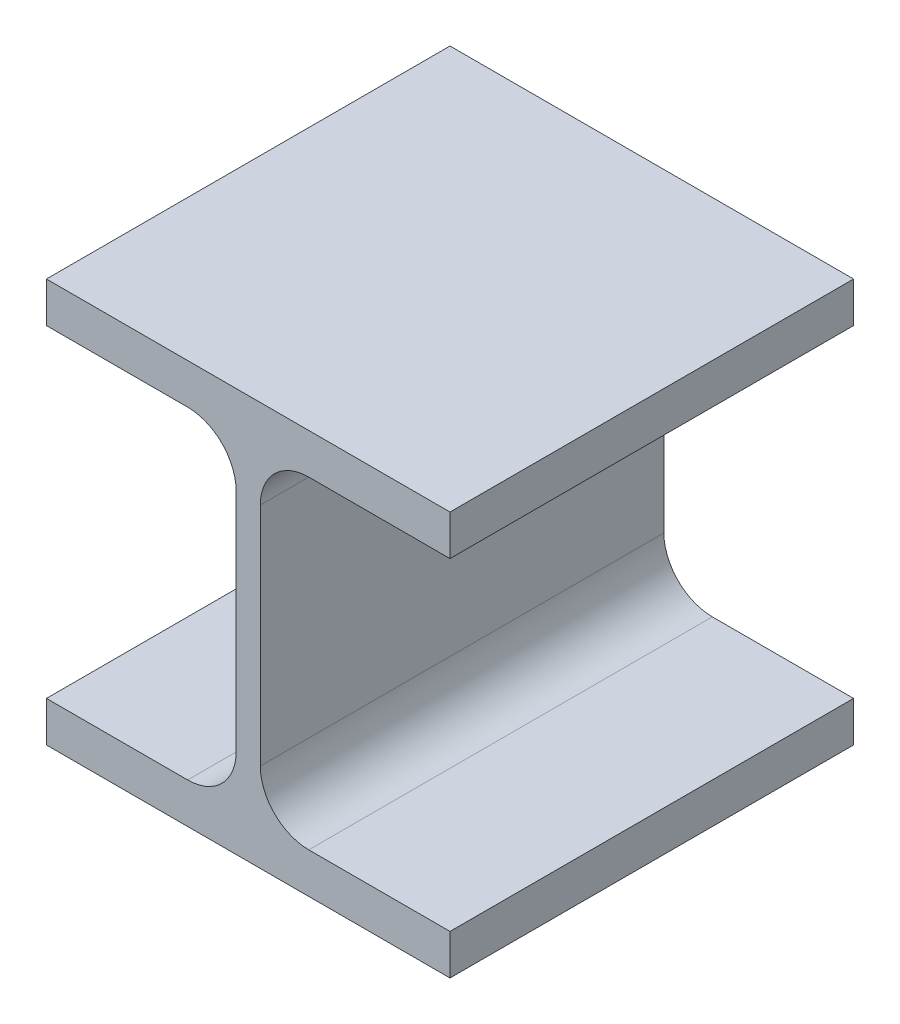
ISO-10303-21;
HEADER;
FILE_DESCRIPTION(('STEP AP214'),'2;1');
FILE_NAME('part.step','',(''),(''),'','','');
FILE_SCHEMA(('AUTOMOTIVE_DESIGN { 1 0 10303 214 1 1 1 1 }'));
ENDSEC;
DATA;
#1=APPLICATION_CONTEXT('core data for automotive mechanical design processes');
#2=APPLICATION_PROTOCOL_DEFINITION('international standard','automotive_design',2000,#1);
#3=PRODUCT_CONTEXT('',#1,'mechanical');
#4=PRODUCT('Part','Part','',(#3));
#5=PRODUCT_RELATED_PRODUCT_CATEGORY('part','',(#4));
#6=PRODUCT_DEFINITION_FORMATION('','',#4);
#7=PRODUCT_DEFINITION_CONTEXT('part definition',#1,'design');
#8=PRODUCT_DEFINITION('design','',#6,#7);
#9=PRODUCT_DEFINITION_SHAPE('','',#8);
#10=(LENGTH_UNIT() NAMED_UNIT(*) SI_UNIT(.MILLI.,.METRE.));
#11=(NAMED_UNIT(*) PLANE_ANGLE_UNIT() SI_UNIT($,.RADIAN.));
#12=(NAMED_UNIT(*) SI_UNIT($,.STERADIAN.) SOLID_ANGLE_UNIT());
#13=UNCERTAINTY_MEASURE_WITH_UNIT(LENGTH_MEASURE(1.E-05),#10,'distance_accuracy_value','');
#14=(GEOMETRIC_REPRESENTATION_CONTEXT(3) GLOBAL_UNCERTAINTY_ASSIGNED_CONTEXT((#13)) GLOBAL_UNIT_ASSIGNED_CONTEXT((#10,
#11,#12)) REPRESENTATION_CONTEXT('',''));
#15=CARTESIAN_POINT('',(0.,0.,0.));
#16=DIRECTION('',(0.,0.,1.));
#17=DIRECTION('',(1.,0.,0.));
#18=AXIS2_PLACEMENT_3D('',#15,#16,#17);
#19=CARTESIAN_POINT('',(49.9999999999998,10.,-100.));
#20=DIRECTION('',(0.,1.,0.));
#21=DIRECTION('',(-1.,0.,0.));
#22=AXIS2_PLACEMENT_3D('',#19,#20,#21);
#23=PLANE('',#22);
#24=DIRECTION('',(-1.,0.,0.));
#25=VECTOR('',#24,1.);
#26=CARTESIAN_POINT('',(49.9999999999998,10.,0.));
#27=LINE('',#26,#25);
#28=CARTESIAN_POINT('',(49.9999999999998,10.,0.));
#29=VERTEX_POINT('',#28);
#30=CARTESIAN_POINT('',(14.9999999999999,10.,0.));
#31=VERTEX_POINT('',#30);
#32=EDGE_CURVE('E138',#29,#31,#27,.T.);
#33=ORIENTED_EDGE('',*,*,#32,.F.);
#34=DIRECTION('',(0.,0.,1.));
#35=VECTOR('',#34,1.);
#36=CARTESIAN_POINT('',(49.9999999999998,10.,-100.));
#37=LINE('',#36,#35);
#38=CARTESIAN_POINT('',(49.9999999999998,10.,-100.));
#39=VERTEX_POINT('',#38);
#40=EDGE_CURVE('E11',#39,#29,#37,.T.);
#41=ORIENTED_EDGE('',*,*,#40,.F.);
#42=DIRECTION('',(-1.,0.,0.));
#43=VECTOR('',#42,1.);
#44=CARTESIAN_POINT('',(49.9999999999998,10.,-100.));
#45=LINE('',#44,#43);
#46=CARTESIAN_POINT('',(14.9999999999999,10.,-100.));
#47=VERTEX_POINT('',#46);
#48=EDGE_CURVE('E140',#39,#47,#45,.T.);
#49=ORIENTED_EDGE('',*,*,#48,.T.);
#50=DIRECTION('',(0.,0.,1.));
#51=VECTOR('',#50,1.);
#52=CARTESIAN_POINT('',(14.9999999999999,10.,-100.));
#53=LINE('',#52,#51);
#54=EDGE_CURVE('E29',#47,#31,#53,.T.);
#55=ORIENTED_EDGE('',*,*,#54,.T.);
#56=EDGE_LOOP('',(#33,#41,#49,#55));
#57=FACE_BOUND('',#56,.T.);
#58=ADVANCED_FACE('F26',(#57),#23,.T.);
#59=CARTESIAN_POINT('',(49.9999999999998,0.,-100.));
#60=DIRECTION('',(1.,0.,0.));
#61=DIRECTION('',(0.,0.,-1.));
#62=AXIS2_PLACEMENT_3D('',#59,#60,#61);
#63=PLANE('',#62);
#64=DIRECTION('',(0.,1.,0.));
#65=VECTOR('',#64,1.);
#66=CARTESIAN_POINT('',(49.9999999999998,0.,0.));
#67=LINE('',#66,#65);
#68=CARTESIAN_POINT('',(49.9999999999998,0.,0.));
#69=VERTEX_POINT('',#68);
#70=EDGE_CURVE('E156',#69,#29,#67,.T.);
#71=ORIENTED_EDGE('',*,*,#70,.F.);
#72=DIRECTION('',(0.,0.,1.));
#73=VECTOR('',#72,1.);
#74=CARTESIAN_POINT('',(49.9999999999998,0.,-100.));
#75=LINE('',#74,#73);
#76=CARTESIAN_POINT('',(49.9999999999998,0.,-100.));
#77=VERTEX_POINT('',#76);
#78=EDGE_CURVE('E34',#77,#69,#75,.T.);
#79=ORIENTED_EDGE('',*,*,#78,.F.);
#80=DIRECTION('',(0.,1.,0.));
#81=VECTOR('',#80,1.);
#82=CARTESIAN_POINT('',(49.9999999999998,0.,-100.));
#83=LINE('',#82,#81);
#84=EDGE_CURVE('E145',#77,#39,#83,.T.);
#85=ORIENTED_EDGE('',*,*,#84,.T.);
#86=ORIENTED_EDGE('',*,*,#40,.T.);
#87=EDGE_LOOP('',(#71,#79,#85,#86));
#88=FACE_BOUND('',#87,.T.);
#89=ADVANCED_FACE('F314',(#88),#63,.T.);
#90=CARTESIAN_POINT('',(-50.0000000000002,0.,-100.));
#91=DIRECTION('',(0.,-1.,0.));
#92=DIRECTION('',(1.,0.,0.));
#93=AXIS2_PLACEMENT_3D('',#90,#91,#92);
#94=PLANE('',#93);
#95=DIRECTION('',(1.,0.,0.));
#96=VECTOR('',#95,1.);
#97=CARTESIAN_POINT('',(-50.0000000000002,0.,0.));
#98=LINE('',#97,#96);
#99=CARTESIAN_POINT('',(-50.0000000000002,0.,0.));
#100=VERTEX_POINT('',#99);
#101=EDGE_CURVE('E187',#100,#69,#98,.T.);
#102=ORIENTED_EDGE('',*,*,#101,.F.);
#103=DIRECTION('',(0.,0.,1.));
#104=VECTOR('',#103,1.);
#105=CARTESIAN_POINT('',(-50.0000000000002,0.,-100.));
#106=LINE('',#105,#104);
#107=CARTESIAN_POINT('',(-50.0000000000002,0.,-100.));
#108=VERTEX_POINT('',#107);
#109=EDGE_CURVE('E225',#108,#100,#106,.T.);
#110=ORIENTED_EDGE('',*,*,#109,.F.);
#111=DIRECTION('',(1.,0.,0.));
#112=VECTOR('',#111,1.);
#113=CARTESIAN_POINT('',(-50.0000000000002,0.,-100.));
#114=LINE('',#113,#112);
#115=EDGE_CURVE('E221',#108,#77,#114,.T.);
#116=ORIENTED_EDGE('',*,*,#115,.T.);
#117=ORIENTED_EDGE('',*,*,#78,.T.);
#118=EDGE_LOOP('',(#102,#110,#116,#117));
#119=FACE_BOUND('',#118,.T.);
#120=ADVANCED_FACE('F312',(#119),#94,.T.);
#121=CARTESIAN_POINT('',(-50.0000000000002,0.,-100.));
#122=DIRECTION('',(1.,0.,0.));
#123=DIRECTION('',(0.,0.,-1.));
#124=AXIS2_PLACEMENT_3D('',#121,#122,#123);
#125=PLANE('',#124);
#126=DIRECTION('',(0.,1.,0.));
#127=VECTOR('',#126,1.);
#128=CARTESIAN_POINT('',(-50.0000000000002,0.,0.));
#129=LINE('',#128,#127);
#130=CARTESIAN_POINT('',(-50.0000000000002,10.,0.));
#131=VERTEX_POINT('',#130);
#132=EDGE_CURVE('E185',#100,#131,#129,.T.);
#133=ORIENTED_EDGE('',*,*,#132,.T.);
#134=DIRECTION('',(0.,0.,1.));
#135=VECTOR('',#134,1.);
#136=CARTESIAN_POINT('',(-50.0000000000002,10.,-100.));
#137=LINE('',#136,#135);
#138=CARTESIAN_POINT('',(-50.0000000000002,10.,-100.));
#139=VERTEX_POINT('',#138);
#140=EDGE_CURVE('E227',#139,#131,#137,.T.);
#141=ORIENTED_EDGE('',*,*,#140,.F.);
#142=DIRECTION('',(0.,1.,0.));
#143=VECTOR('',#142,1.);
#144=CARTESIAN_POINT('',(-50.0000000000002,0.,-100.));
#145=LINE('',#144,#143);
#146=EDGE_CURVE('E219',#108,#139,#145,.T.);
#147=ORIENTED_EDGE('',*,*,#146,.F.);
#148=ORIENTED_EDGE('',*,*,#109,.T.);
#149=EDGE_LOOP('',(#133,#141,#147,#148));
#150=FACE_BOUND('',#149,.T.);
#151=ADVANCED_FACE('F309',(#150),#125,.F.);
#152=CARTESIAN_POINT('',(-50.0000000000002,10.,-100.));
#153=DIRECTION('',(0.,-1.,0.));
#154=DIRECTION('',(1.,0.,0.));
#155=AXIS2_PLACEMENT_3D('',#152,#153,#154);
#156=PLANE('',#155);
#157=DIRECTION('',(1.,0.,0.));
#158=VECTOR('',#157,1.);
#159=CARTESIAN_POINT('',(-50.0000000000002,10.,0.));
#160=LINE('',#159,#158);
#161=CARTESIAN_POINT('',(-15.,10.0000000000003,0.));
#162=VERTEX_POINT('',#161);
#163=EDGE_CURVE('E183',#131,#162,#160,.T.);
#164=ORIENTED_EDGE('',*,*,#163,.T.);
#165=DIRECTION('',(0.,0.,1.));
#166=VECTOR('',#165,1.);
#167=CARTESIAN_POINT('',(-15.,10.0000000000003,-100.));
#168=LINE('',#167,#166);
#169=CARTESIAN_POINT('',(-15.,10.0000000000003,-100.));
#170=VERTEX_POINT('',#169);
#171=EDGE_CURVE('E230',#170,#162,#168,.T.);
#172=ORIENTED_EDGE('',*,*,#171,.F.);
#173=DIRECTION('',(1.,0.,0.));
#174=VECTOR('',#173,1.);
#175=CARTESIAN_POINT('',(-50.0000000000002,10.,-100.));
#176=LINE('',#175,#174);
#177=EDGE_CURVE('E217',#139,#170,#176,.T.);
#178=ORIENTED_EDGE('',*,*,#177,.F.);
#179=ORIENTED_EDGE('',*,*,#140,.T.);
#180=EDGE_LOOP('',(#164,#172,#178,#179));
#181=FACE_BOUND('',#180,.T.);
#182=ADVANCED_FACE('F304',(#181),#156,.F.);
#183=CARTESIAN_POINT('',(-15.0000000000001,22.0000000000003,-100.));
#184=DIRECTION('',(0.,0.,1.));
#185=DIRECTION('',(1.,0.,0.));
#186=AXIS2_PLACEMENT_3D('',#183,#184,#185);
#187=CYLINDRICAL_SURFACE('',#186,12.);
#188=CARTESIAN_POINT('',(-15.0000000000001,22.0000000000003,0.));
#189=DIRECTION('',(0.,0.,1.));
#190=DIRECTION('',(1.,0.,0.));
#191=AXIS2_PLACEMENT_3D('',#188,#189,#190);
#192=CIRCLE('',#191,12.);
#193=CARTESIAN_POINT('',(-3.00000000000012,22.0000000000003,0.));
#194=VERTEX_POINT('',#193);
#195=EDGE_CURVE('E181',#162,#194,#192,.T.);
#196=ORIENTED_EDGE('',*,*,#195,.T.);
#197=DIRECTION('',(0.,0.,1.));
#198=VECTOR('',#197,1.);
#199=CARTESIAN_POINT('',(-3.00000000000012,22.0000000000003,-100.));
#200=LINE('',#199,#198);
#201=CARTESIAN_POINT('',(-3.00000000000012,22.0000000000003,-100.));
#202=VERTEX_POINT('',#201);
#203=EDGE_CURVE('E233',#202,#194,#200,.T.);
#204=ORIENTED_EDGE('',*,*,#203,.F.);
#205=CARTESIAN_POINT('',(-15.0000000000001,22.0000000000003,-100.));
#206=DIRECTION('',(0.,0.,1.));
#207=DIRECTION('',(1.,0.,0.));
#208=AXIS2_PLACEMENT_3D('',#205,#206,#207);
#209=CIRCLE('',#208,12.);
#210=EDGE_CURVE('E215',#170,#202,#209,.T.);
#211=ORIENTED_EDGE('',*,*,#210,.F.);
#212=ORIENTED_EDGE('',*,*,#171,.T.);
#213=EDGE_LOOP('',(#196,#204,#211,#212));
#214=FACE_BOUND('',#213,.T.);
#215=ADVANCED_FACE('F298',(#214),#187,.F.);
#216=CARTESIAN_POINT('',(-3.00000000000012,22.0000000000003,-100.));
#217=DIRECTION('',(1.,0.,0.));
#218=DIRECTION('',(0.,0.,-1.));
#219=AXIS2_PLACEMENT_3D('',#216,#217,#218);
#220=PLANE('',#219);
#221=DIRECTION('',(0.,1.,0.));
#222=VECTOR('',#221,1.);
#223=CARTESIAN_POINT('',(-3.00000000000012,22.0000000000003,0.));
#224=LINE('',#223,#222);
#225=CARTESIAN_POINT('',(-3.00000000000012,78.0000000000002,0.));
#226=VERTEX_POINT('',#225);
#227=EDGE_CURVE('E179',#194,#226,#224,.T.);
#228=ORIENTED_EDGE('',*,*,#227,.T.);
#229=DIRECTION('',(0.,0.,1.));
#230=VECTOR('',#229,1.);
#231=CARTESIAN_POINT('',(-3.00000000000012,78.0000000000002,-100.));
#232=LINE('',#231,#230);
#233=CARTESIAN_POINT('',(-3.00000000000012,78.0000000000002,-100.));
#234=VERTEX_POINT('',#233);
#235=EDGE_CURVE('E236',#234,#226,#232,.T.);
#236=ORIENTED_EDGE('',*,*,#235,.F.);
#237=DIRECTION('',(0.,1.,0.));
#238=VECTOR('',#237,1.);
#239=CARTESIAN_POINT('',(-3.00000000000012,22.0000000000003,-100.));
#240=LINE('',#239,#238);
#241=EDGE_CURVE('E213',#202,#234,#240,.T.);
#242=ORIENTED_EDGE('',*,*,#241,.F.);
#243=ORIENTED_EDGE('',*,*,#203,.T.);
#244=EDGE_LOOP('',(#228,#236,#242,#243));
#245=FACE_BOUND('',#244,.T.);
#246=ADVANCED_FACE('F294',(#245),#220,.F.);
#247=CARTESIAN_POINT('',(-15.0000000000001,78.0000000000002,-100.));
#248=DIRECTION('',(0.,0.,1.));
#249=DIRECTION('',(1.,0.,0.));
#250=AXIS2_PLACEMENT_3D('',#247,#248,#249);
#251=CYLINDRICAL_SURFACE('',#250,12.);
#252=CARTESIAN_POINT('',(-15.0000000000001,78.0000000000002,0.));
#253=DIRECTION('',(0.,0.,1.));
#254=DIRECTION('',(1.,0.,0.));
#255=AXIS2_PLACEMENT_3D('',#252,#253,#254);
#256=CIRCLE('',#255,12.);
#257=CARTESIAN_POINT('',(-15.0000000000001,90.0000000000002,0.));
#258=VERTEX_POINT('',#257);
#259=EDGE_CURVE('E177',#226,#258,#256,.T.);
#260=ORIENTED_EDGE('',*,*,#259,.T.);
#261=DIRECTION('',(0.,0.,1.));
#262=VECTOR('',#261,1.);
#263=CARTESIAN_POINT('',(-15.0000000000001,90.0000000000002,-100.));
#264=LINE('',#263,#262);
#265=CARTESIAN_POINT('',(-15.0000000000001,90.0000000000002,-100.));
#266=VERTEX_POINT('',#265);
#267=EDGE_CURVE('E239',#266,#258,#264,.T.);
#268=ORIENTED_EDGE('',*,*,#267,.F.);
#269=CARTESIAN_POINT('',(-15.0000000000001,78.0000000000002,-100.));
#270=DIRECTION('',(0.,0.,1.));
#271=DIRECTION('',(1.,0.,0.));
#272=AXIS2_PLACEMENT_3D('',#269,#270,#271);
#273=CIRCLE('',#272,12.);
#274=EDGE_CURVE('E211',#234,#266,#273,.T.);
#275=ORIENTED_EDGE('',*,*,#274,.F.);
#276=ORIENTED_EDGE('',*,*,#235,.T.);
#277=EDGE_LOOP('',(#260,#268,#275,#276));
#278=FACE_BOUND('',#277,.T.);
#279=ADVANCED_FACE('F289',(#278),#251,.F.);
#280=CARTESIAN_POINT('',(-15.0000000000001,90.0000000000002,-100.));
#281=DIRECTION('',(0.,1.,0.));
#282=DIRECTION('',(0.,0.,1.));
#283=AXIS2_PLACEMENT_3D('',#280,#281,#282);
#284=PLANE('',#283);
#285=DIRECTION('',(-1.,0.,0.));
#286=VECTOR('',#285,1.);
#287=CARTESIAN_POINT('',(-15.0000000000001,90.0000000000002,0.));
#288=LINE('',#287,#286);
#289=CARTESIAN_POINT('',(-50.0000000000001,90.0000000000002,0.));
#290=VERTEX_POINT('',#289);
#291=EDGE_CURVE('E175',#258,#290,#288,.T.);
#292=ORIENTED_EDGE('',*,*,#291,.T.);
#293=DIRECTION('',(0.,0.,1.));
#294=VECTOR('',#293,1.);
#295=CARTESIAN_POINT('',(-50.0000000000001,90.0000000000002,-100.));
#296=LINE('',#295,#294);
#297=CARTESIAN_POINT('',(-50.0000000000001,90.0000000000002,-100.));
#298=VERTEX_POINT('',#297);
#299=EDGE_CURVE('E242',#298,#290,#296,.T.);
#300=ORIENTED_EDGE('',*,*,#299,.F.);
#301=DIRECTION('',(-1.,0.,0.));
#302=VECTOR('',#301,1.);
#303=CARTESIAN_POINT('',(-15.0000000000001,90.0000000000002,-100.));
#304=LINE('',#303,#302);
#305=EDGE_CURVE('E209',#266,#298,#304,.T.);
#306=ORIENTED_EDGE('',*,*,#305,.F.);
#307=ORIENTED_EDGE('',*,*,#267,.T.);
#308=EDGE_LOOP('',(#292,#300,#306,#307));
#309=FACE_BOUND('',#308,.T.);
#310=ADVANCED_FACE('F283',(#309),#284,.F.);
#311=CARTESIAN_POINT('',(-50.0000000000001,90.0000000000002,-100.));
#312=DIRECTION('',(1.,0.,0.));
#313=DIRECTION('',(0.,1.,0.));
#314=AXIS2_PLACEMENT_3D('',#311,#312,#313);
#315=PLANE('',#314);
#316=DIRECTION('',(0.,1.,0.));
#317=VECTOR('',#316,1.);
#318=CARTESIAN_POINT('',(-50.0000000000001,90.0000000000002,0.));
#319=LINE('',#318,#317);
#320=CARTESIAN_POINT('',(-50.0000000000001,100.,0.));
#321=VERTEX_POINT('',#320);
#322=EDGE_CURVE('E172',#290,#321,#319,.T.);
#323=ORIENTED_EDGE('',*,*,#322,.T.);
#324=DIRECTION('',(0.,0.,1.));
#325=VECTOR('',#324,1.);
#326=CARTESIAN_POINT('',(-50.0000000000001,100.,-100.));
#327=LINE('',#326,#325);
#328=CARTESIAN_POINT('',(-50.0000000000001,100.,-100.));
#329=VERTEX_POINT('',#328);
#330=EDGE_CURVE('E245',#329,#321,#327,.T.);
#331=ORIENTED_EDGE('',*,*,#330,.F.);
#332=DIRECTION('',(0.,1.,0.));
#333=VECTOR('',#332,1.);
#334=CARTESIAN_POINT('',(-50.0000000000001,90.0000000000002,-100.));
#335=LINE('',#334,#333);
#336=EDGE_CURVE('E207',#298,#329,#335,.T.);
#337=ORIENTED_EDGE('',*,*,#336,.F.);
#338=ORIENTED_EDGE('',*,*,#299,.T.);
#339=EDGE_LOOP('',(#323,#331,#337,#338));
#340=FACE_BOUND('',#339,.T.);
#341=ADVANCED_FACE('F279',(#340),#315,.F.);
#342=CARTESIAN_POINT('',(49.9999999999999,100.,-100.));
#343=DIRECTION('',(0.,1.,0.));
#344=DIRECTION('',(0.,0.,1.));
#345=AXIS2_PLACEMENT_3D('',#342,#343,#344);
#346=PLANE('',#345);
#347=DIRECTION('',(-1.,0.,0.));
#348=VECTOR('',#347,1.);
#349=CARTESIAN_POINT('',(49.9999999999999,100.,0.));
#350=LINE('',#349,#348);
#351=CARTESIAN_POINT('',(49.9999999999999,100.,0.));
#352=VERTEX_POINT('',#351);
#353=EDGE_CURVE('E169',#352,#321,#350,.T.);
#354=ORIENTED_EDGE('',*,*,#353,.F.);
#355=DIRECTION('',(0.,0.,1.));
#356=VECTOR('',#355,1.);
#357=CARTESIAN_POINT('',(49.9999999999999,100.,-100.));
#358=LINE('',#357,#356);
#359=CARTESIAN_POINT('',(49.9999999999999,100.,-100.));
#360=VERTEX_POINT('',#359);
#361=EDGE_CURVE('E247',#360,#352,#358,.T.);
#362=ORIENTED_EDGE('',*,*,#361,.F.);
#363=DIRECTION('',(-1.,0.,0.));
#364=VECTOR('',#363,1.);
#365=CARTESIAN_POINT('',(49.9999999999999,100.,-100.));
#366=LINE('',#365,#364);
#367=EDGE_CURVE('E204',#360,#329,#366,.T.);
#368=ORIENTED_EDGE('',*,*,#367,.T.);
#369=ORIENTED_EDGE('',*,*,#330,.T.);
#370=EDGE_LOOP('',(#354,#362,#368,#369));
#371=FACE_BOUND('',#370,.T.);
#372=ADVANCED_FACE('F274',(#371),#346,.T.);
#373=CARTESIAN_POINT('',(49.9999999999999,90.,-100.));
#374=DIRECTION('',(1.,0.,0.));
#375=DIRECTION('',(0.,1.,0.));
#376=AXIS2_PLACEMENT_3D('',#373,#374,#375);
#377=PLANE('',#376);
#378=DIRECTION('',(0.,1.,0.));
#379=VECTOR('',#378,1.);
#380=CARTESIAN_POINT('',(49.9999999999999,90.,0.));
#381=LINE('',#380,#379);
#382=CARTESIAN_POINT('',(49.9999999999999,90.,0.));
#383=VERTEX_POINT('',#382);
#384=EDGE_CURVE('E166',#383,#352,#381,.T.);
#385=ORIENTED_EDGE('',*,*,#384,.F.);
#386=DIRECTION('',(0.,0.,1.));
#387=VECTOR('',#386,1.);
#388=CARTESIAN_POINT('',(49.9999999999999,90.,-100.));
#389=LINE('',#388,#387);
#390=CARTESIAN_POINT('',(49.9999999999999,90.,-100.));
#391=VERTEX_POINT('',#390);
#392=EDGE_CURVE('E249',#391,#383,#389,.T.);
#393=ORIENTED_EDGE('',*,*,#392,.F.);
#394=DIRECTION('',(0.,1.,0.));
#395=VECTOR('',#394,1.);
#396=CARTESIAN_POINT('',(49.9999999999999,90.,-100.));
#397=LINE('',#396,#395);
#398=EDGE_CURVE('E201',#391,#360,#397,.T.);
#399=ORIENTED_EDGE('',*,*,#398,.T.);
#400=ORIENTED_EDGE('',*,*,#361,.T.);
#401=EDGE_LOOP('',(#385,#393,#399,#400));
#402=FACE_BOUND('',#401,.T.);
#403=ADVANCED_FACE('F269',(#402),#377,.T.);
#404=CARTESIAN_POINT('',(14.9999999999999,90.0000000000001,-100.));
#405=DIRECTION('',(0.,-1.,0.));
#406=DIRECTION('',(1.,0.,0.));
#407=AXIS2_PLACEMENT_3D('',#404,#405,#406);
#408=PLANE('',#407);
#409=DIRECTION('',(1.,0.,0.));
#410=VECTOR('',#409,1.);
#411=CARTESIAN_POINT('',(14.9999999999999,90.0000000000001,0.));
#412=LINE('',#411,#410);
#413=CARTESIAN_POINT('',(14.9999999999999,90.0000000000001,0.));
#414=VERTEX_POINT('',#413);
#415=EDGE_CURVE('E163',#414,#383,#412,.T.);
#416=ORIENTED_EDGE('',*,*,#415,.F.);
#417=DIRECTION('',(0.,0.,1.));
#418=VECTOR('',#417,1.);
#419=CARTESIAN_POINT('',(14.9999999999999,90.0000000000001,-100.));
#420=LINE('',#419,#418);
#421=CARTESIAN_POINT('',(14.9999999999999,90.0000000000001,-100.));
#422=VERTEX_POINT('',#421);
#423=EDGE_CURVE('E251',#422,#414,#420,.T.);
#424=ORIENTED_EDGE('',*,*,#423,.F.);
#425=DIRECTION('',(1.,0.,0.));
#426=VECTOR('',#425,1.);
#427=CARTESIAN_POINT('',(14.9999999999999,90.0000000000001,-100.));
#428=LINE('',#427,#426);
#429=EDGE_CURVE('E198',#422,#391,#428,.T.);
#430=ORIENTED_EDGE('',*,*,#429,.T.);
#431=ORIENTED_EDGE('',*,*,#392,.T.);
#432=EDGE_LOOP('',(#416,#424,#430,#431));
#433=FACE_BOUND('',#432,.T.);
#434=ADVANCED_FACE('F264',(#433),#408,.T.);
#435=CARTESIAN_POINT('',(14.9999999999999,78.0000000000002,-100.));
#436=DIRECTION('',(0.,0.,1.));
#437=DIRECTION('',(1.,0.,0.));
#438=AXIS2_PLACEMENT_3D('',#435,#436,#437);
#439=CYLINDRICAL_SURFACE('',#438,12.);
#440=CARTESIAN_POINT('',(14.9999999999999,78.0000000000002,0.));
#441=DIRECTION('',(0.,0.,1.));
#442=DIRECTION('',(1.,0.,0.));
#443=AXIS2_PLACEMENT_3D('',#440,#441,#442);
#444=CIRCLE('',#443,12.);
#445=CARTESIAN_POINT('',(2.99999999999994,78.0000000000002,0.));
#446=VERTEX_POINT('',#445);
#447=EDGE_CURVE('E160',#414,#446,#444,.T.);
#448=ORIENTED_EDGE('',*,*,#447,.T.);
#449=DIRECTION('',(0.,0.,1.));
#450=VECTOR('',#449,1.);
#451=CARTESIAN_POINT('',(2.99999999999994,78.0000000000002,-100.));
#452=LINE('',#451,#450);
#453=CARTESIAN_POINT('',(2.99999999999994,78.0000000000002,-100.));
#454=VERTEX_POINT('',#453);
#455=EDGE_CURVE('E253',#454,#446,#452,.T.);
#456=ORIENTED_EDGE('',*,*,#455,.F.);
#457=CARTESIAN_POINT('',(14.9999999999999,78.0000000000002,-100.));
#458=DIRECTION('',(0.,0.,1.));
#459=DIRECTION('',(1.,0.,0.));
#460=AXIS2_PLACEMENT_3D('',#457,#458,#459);
#461=CIRCLE('',#460,12.);
#462=EDGE_CURVE('E196',#422,#454,#461,.T.);
#463=ORIENTED_EDGE('',*,*,#462,.F.);
#464=ORIENTED_EDGE('',*,*,#423,.T.);
#465=EDGE_LOOP('',(#448,#456,#463,#464));
#466=FACE_BOUND('',#465,.T.);
#467=ADVANCED_FACE('F261',(#466),#439,.F.);
#468=CARTESIAN_POINT('',(2.99999999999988,22.,-100.));
#469=DIRECTION('',(1.,0.,0.));
#470=DIRECTION('',(0.,0.,-1.));
#471=AXIS2_PLACEMENT_3D('',#468,#469,#470);
#472=PLANE('',#471);
#473=DIRECTION('',(0.,1.,0.));
#474=VECTOR('',#473,1.);
#475=CARTESIAN_POINT('',(2.99999999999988,22.,0.));
#476=LINE('',#475,#474);
#477=CARTESIAN_POINT('',(2.99999999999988,22.,0.));
#478=VERTEX_POINT('',#477);
#479=EDGE_CURVE('E152',#478,#446,#476,.T.);
#480=ORIENTED_EDGE('',*,*,#479,.F.);
#481=DIRECTION('',(0.,0.,1.));
#482=VECTOR('',#481,1.);
#483=CARTESIAN_POINT('',(2.99999999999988,22.,-100.));
#484=LINE('',#483,#482);
#485=CARTESIAN_POINT('',(2.99999999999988,22.,-100.));
#486=VERTEX_POINT('',#485);
#487=EDGE_CURVE('E144',#486,#478,#484,.T.);
#488=ORIENTED_EDGE('',*,*,#487,.F.);
#489=DIRECTION('',(0.,1.,0.));
#490=VECTOR('',#489,1.);
#491=CARTESIAN_POINT('',(2.99999999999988,22.,-100.));
#492=LINE('',#491,#490);
#493=EDGE_CURVE('E193',#486,#454,#492,.T.);
#494=ORIENTED_EDGE('',*,*,#493,.T.);
#495=ORIENTED_EDGE('',*,*,#455,.T.);
#496=EDGE_LOOP('',(#480,#488,#494,#495));
#497=FACE_BOUND('',#496,.T.);
#498=ADVANCED_FACE('F256',(#497),#472,.T.);
#499=CARTESIAN_POINT('',(14.9999999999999,22.,-100.));
#500=DIRECTION('',(0.,0.,1.));
#501=DIRECTION('',(1.,0.,0.));
#502=AXIS2_PLACEMENT_3D('',#499,#500,#501);
#503=CYLINDRICAL_SURFACE('',#502,12.);
#504=CARTESIAN_POINT('',(14.9999999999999,22.,0.));
#505=DIRECTION('',(0.,0.,-1.));
#506=DIRECTION('',(-1.,0.,0.));
#507=AXIS2_PLACEMENT_3D('',#504,#505,#506);
#508=CIRCLE('',#507,12.);
#509=EDGE_CURVE('E147',#31,#478,#508,.T.);
#510=ORIENTED_EDGE('',*,*,#509,.F.);
#511=ORIENTED_EDGE('',*,*,#54,.F.);
#512=CARTESIAN_POINT('',(14.9999999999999,22.,-100.));
#513=DIRECTION('',(0.,0.,-1.));
#514=DIRECTION('',(-1.,0.,0.));
#515=AXIS2_PLACEMENT_3D('',#512,#513,#514);
#516=CIRCLE('',#515,12.);
#517=EDGE_CURVE('E191',#47,#486,#516,.T.);
#518=ORIENTED_EDGE('',*,*,#517,.T.);
#519=ORIENTED_EDGE('',*,*,#487,.T.);
#520=EDGE_LOOP('',(#510,#511,#518,#519));
#521=FACE_BOUND('',#520,.T.);
#522=ADVANCED_FACE('F148',(#521),#503,.F.);
#523=CARTESIAN_POINT('',(14.9999999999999,22.,-100.));
#524=DIRECTION('',(0.,0.,-1.));
#525=DIRECTION('',(-1.,0.,0.));
#526=AXIS2_PLACEMENT_3D('',#523,#524,#525);
#527=PLANE('',#526);
#528=ORIENTED_EDGE('',*,*,#48,.F.);
#529=ORIENTED_EDGE('',*,*,#84,.F.);
#530=ORIENTED_EDGE('',*,*,#115,.F.);
#531=ORIENTED_EDGE('',*,*,#146,.T.);
#532=ORIENTED_EDGE('',*,*,#177,.T.);
#533=ORIENTED_EDGE('',*,*,#210,.T.);
#534=ORIENTED_EDGE('',*,*,#241,.T.);
#535=ORIENTED_EDGE('',*,*,#274,.T.);
#536=ORIENTED_EDGE('',*,*,#305,.T.);
#537=ORIENTED_EDGE('',*,*,#336,.T.);
#538=ORIENTED_EDGE('',*,*,#367,.F.);
#539=ORIENTED_EDGE('',*,*,#398,.F.);
#540=ORIENTED_EDGE('',*,*,#429,.F.);
#541=ORIENTED_EDGE('',*,*,#462,.T.);
#542=ORIENTED_EDGE('',*,*,#493,.F.);
#543=ORIENTED_EDGE('',*,*,#517,.F.);
#544=EDGE_LOOP('',(#528,#529,#530,#531,#532,#533,#534,#535,#536,#537,#538,#539,#540,#541,#542,#543));
#545=FACE_BOUND('',#544,.T.);
#546=ADVANCED_FACE('F316',(#545),#527,.T.);
#547=CARTESIAN_POINT('',(14.9999999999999,22.,0.));
#548=DIRECTION('',(0.,0.,-1.));
#549=DIRECTION('',(-1.,0.,0.));
#550=AXIS2_PLACEMENT_3D('',#547,#548,#549);
#551=PLANE('',#550);
#552=ORIENTED_EDGE('',*,*,#32,.T.);
#553=ORIENTED_EDGE('',*,*,#509,.T.);
#554=ORIENTED_EDGE('',*,*,#479,.T.);
#555=ORIENTED_EDGE('',*,*,#447,.F.);
#556=ORIENTED_EDGE('',*,*,#415,.T.);
#557=ORIENTED_EDGE('',*,*,#384,.T.);
#558=ORIENTED_EDGE('',*,*,#353,.T.);
#559=ORIENTED_EDGE('',*,*,#322,.F.);
#560=ORIENTED_EDGE('',*,*,#291,.F.);
#561=ORIENTED_EDGE('',*,*,#259,.F.);
#562=ORIENTED_EDGE('',*,*,#227,.F.);
#563=ORIENTED_EDGE('',*,*,#195,.F.);
#564=ORIENTED_EDGE('',*,*,#163,.F.);
#565=ORIENTED_EDGE('',*,*,#132,.F.);
#566=ORIENTED_EDGE('',*,*,#101,.T.);
#567=ORIENTED_EDGE('',*,*,#70,.T.);
#568=EDGE_LOOP('',(#552,#553,#554,#555,#556,#557,#558,#559,#560,#561,#562,#563,#564,#565,#566,#567));
#569=FACE_BOUND('',#568,.T.);
#570=ADVANCED_FACE('F154',(#569),#551,.F.);
#571=CLOSED_SHELL('',(#58,#89,#120,#151,#182,#215,#246,#279,#310,#341,#372,#403,#434,#467,#498,
#522,#546,#570));
#572=MANIFOLD_SOLID_BREP('B2',#571);
#573=ADVANCED_BREP_SHAPE_REPRESENTATION('',(#18,#572),#14);
#574=SHAPE_DEFINITION_REPRESENTATION(#9,#573);
ENDSEC;
END-ISO-10303-21;
